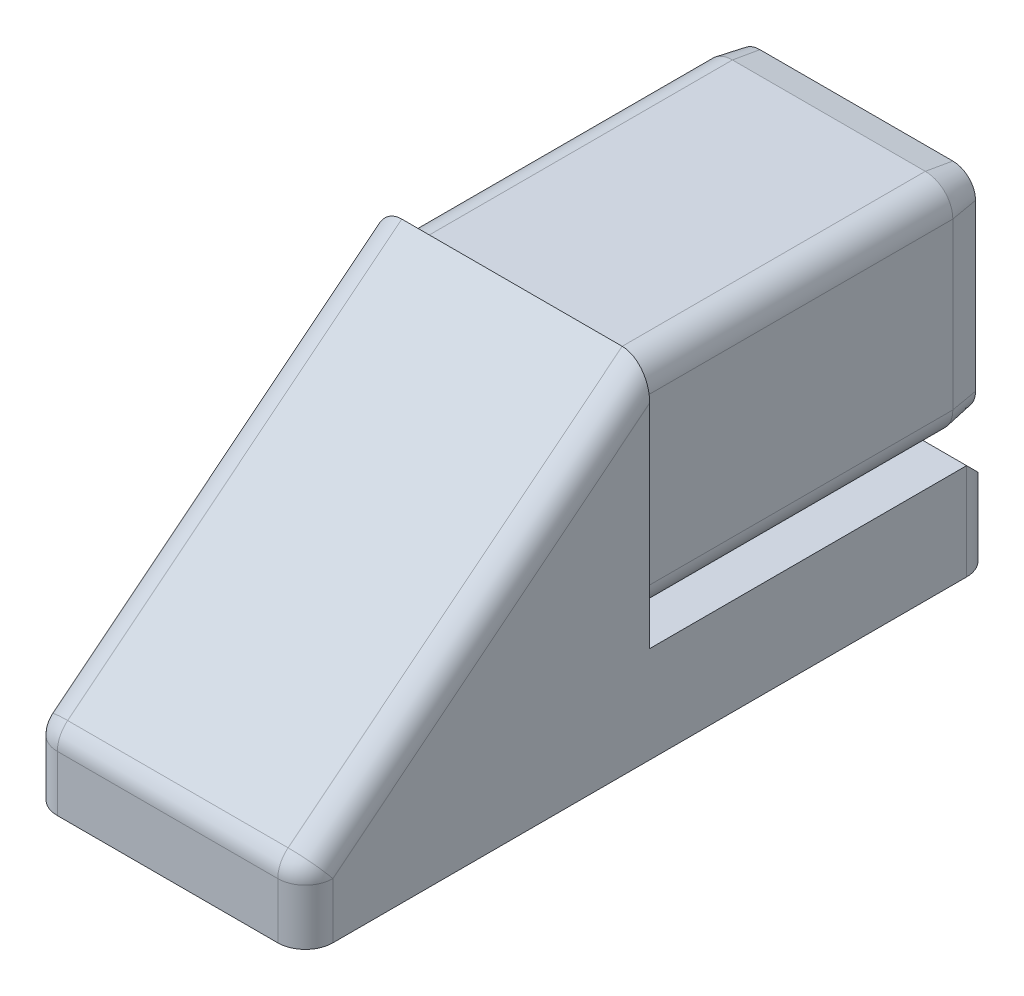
from build123d import *
from OCP.BRepFilletAPI import BRepFilletAPI_MakeChamfer

# Parameters (mm, degrees)
BOSS_EXTRU_2_DEPTH = 20
BOSS_EXTRU_3_DEPTH = 50
CONG_1_R           = 4
CHANFREIN1_SIZE    = 4
CHANFREIN1_SIZE2   = 0.705307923


with BuildPart() as part:
    # Esquisse1 → Boss.-Extru.2 (new, symmetric)
    with BuildSketch(Plane(origin=(0, 0, 0), x_dir=(0, 0, -1), z_dir=(1, 0, 0))):
        Polygon((0, 20), (-50, -20), (-50, -30), (0, -30), align=None)
    extrude(amount=BOSS_EXTRU_2_DEPTH, both=True)

    # Esquisse2 → Boss.-Extru.3 (add)
    with BuildSketch(Plane.XY):
        with BuildLine():
            Line((-14, 18), (14, 18))
            ThreePointArc((14, 18), (16.828427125, 16.828427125), (18, 14))
            Line((18, 14), (18, -14))
            Line((18, -14), (-18, -14))
            Line((-18, -14), (-18, 14))
            ThreePointArc((-18, 14), (-16.828427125, 16.828427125), (-14, 18))
        make_face()
        with BuildLine():
            Line((20, -16), (20, -30))
            Line((20, -30), (-20, -30))
            Line((-20, -30), (-20, -16))
            ThreePointArc((-20, -16), (-18.828427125, -18.828427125), (-16, -20))
            Line((-16, -20), (16, -20))
            ThreePointArc((16, -20), (18.828427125, -18.828427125), (20, -16))
        make_face()
    extrude(amount=-BOSS_EXTRU_3_DEPTH)

    # Cong_1
    cong_1_edges = [part.edges().sort_by_distance(p)[0] for p in [
        (-18, -14, -25),
        (18, -14, -25),
        (-20, -23, -50),
        (20, -23, -50),
        (-20, -25, 50),
        (20, -25, 50),
        (-20, 0, 25),
        (20, 0, 25),
        (0, -20, 50),
    ]]
    fillet(cong_1_edges, radius=CONG_1_R)

    # Chanfrein1: one chamfer whose edges measure the first distance from different faces: ONE call of the kernel's chamfer builder (chamfer() names one face for all edges)
    chanfrein1_edges_1 = [part.edges().sort_by_distance(p)[0] for p in [
        (-18, 2, -50),
    ]]
    chanfrein1_side_1 = [part.faces().sort_by_distance(p)[0] for p in [
        (-18, 2, -25),
    ]]
    chanfrein1_edges_2 = [part.edges().sort_by_distance(p)[0] for p in [
        (-16.828427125, 16.828427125, -50),
    ]]
    chanfrein1_side_2 = [part.faces().sort_by_distance(p)[0] for p in [
        (-16.828427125, 16.828427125, -25),
    ]]
    chanfrein1_edges_3 = [part.edges().sort_by_distance(p)[0] for p in [
        (0, 18, -50),
    ]]
    chanfrein1_side_3 = [part.faces().sort_by_distance(p)[0] for p in [
        (0, 18, -25),
    ]]
    chanfrein1_edges_4 = [part.edges().sort_by_distance(p)[0] for p in [
        (16.828427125, 16.828427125, -50),
    ]]
    chanfrein1_side_4 = [part.faces().sort_by_distance(p)[0] for p in [
        (16.828427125, 16.828427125, -25),
    ]]
    chanfrein1_edges_5 = [part.edges().sort_by_distance(p)[0] for p in [
        (0, -14, -50),
    ]]
    chanfrein1_side_5 = [part.faces().sort_by_distance(p)[0] for p in [
        (0, -14, -25),
    ]]
    chanfrein1_edges_6 = [part.edges().sort_by_distance(p)[0] for p in [
        (18, 2, -50),
    ]]
    chanfrein1_side_6 = [part.faces().sort_by_distance(p)[0] for p in [
        (18, 2, -25),
    ]]
    chanfrein1_edges_7 = [part.edges().sort_by_distance(p)[0] for p in [
        (16.828427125, -12.828427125, -50),
    ]]
    chanfrein1_side_7 = [part.faces().sort_by_distance(p)[0] for p in [
        (16.828427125, -12.828427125, -25),
    ]]
    chanfrein1_edges_8 = [part.edges().sort_by_distance(p)[0] for p in [
        (-16.828427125, -12.828427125, -50),
    ]]
    chanfrein1_side_8 = [part.faces().sort_by_distance(p)[0] for p in [
        (-16.828427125, -12.828427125, -25),
    ]]
    chanfrein1 = BRepFilletAPI_MakeChamfer(part.part.solid().wrapped)
    for e in chanfrein1_edges_1:
        chanfrein1.Add(CHANFREIN1_SIZE, CHANFREIN1_SIZE2, e.wrapped, chanfrein1_side_1[0].wrapped)  # the first distance lies on this face
    for e in chanfrein1_edges_2:
        chanfrein1.Add(CHANFREIN1_SIZE, CHANFREIN1_SIZE2, e.wrapped, chanfrein1_side_2[0].wrapped)  # the first distance lies on this face
    for e in chanfrein1_edges_3:
        chanfrein1.Add(CHANFREIN1_SIZE, CHANFREIN1_SIZE2, e.wrapped, chanfrein1_side_3[0].wrapped)  # the first distance lies on this face
    for e in chanfrein1_edges_4:
        chanfrein1.Add(CHANFREIN1_SIZE, CHANFREIN1_SIZE2, e.wrapped, chanfrein1_side_4[0].wrapped)  # the first distance lies on this face
    for e in chanfrein1_edges_5:
        chanfrein1.Add(CHANFREIN1_SIZE, CHANFREIN1_SIZE2, e.wrapped, chanfrein1_side_5[0].wrapped)  # the first distance lies on this face
    for e in chanfrein1_edges_6:
        chanfrein1.Add(CHANFREIN1_SIZE, CHANFREIN1_SIZE2, e.wrapped, chanfrein1_side_6[0].wrapped)  # the first distance lies on this face
    for e in chanfrein1_edges_7:
        chanfrein1.Add(CHANFREIN1_SIZE, CHANFREIN1_SIZE2, e.wrapped, chanfrein1_side_7[0].wrapped)  # the first distance lies on this face
    for e in chanfrein1_edges_8:
        chanfrein1.Add(CHANFREIN1_SIZE, CHANFREIN1_SIZE2, e.wrapped, chanfrein1_side_8[0].wrapped)  # the first distance lies on this face
    add(Compound.cast(chanfrein1.Shape()), mode=Mode.REPLACE)


solid = part.part
